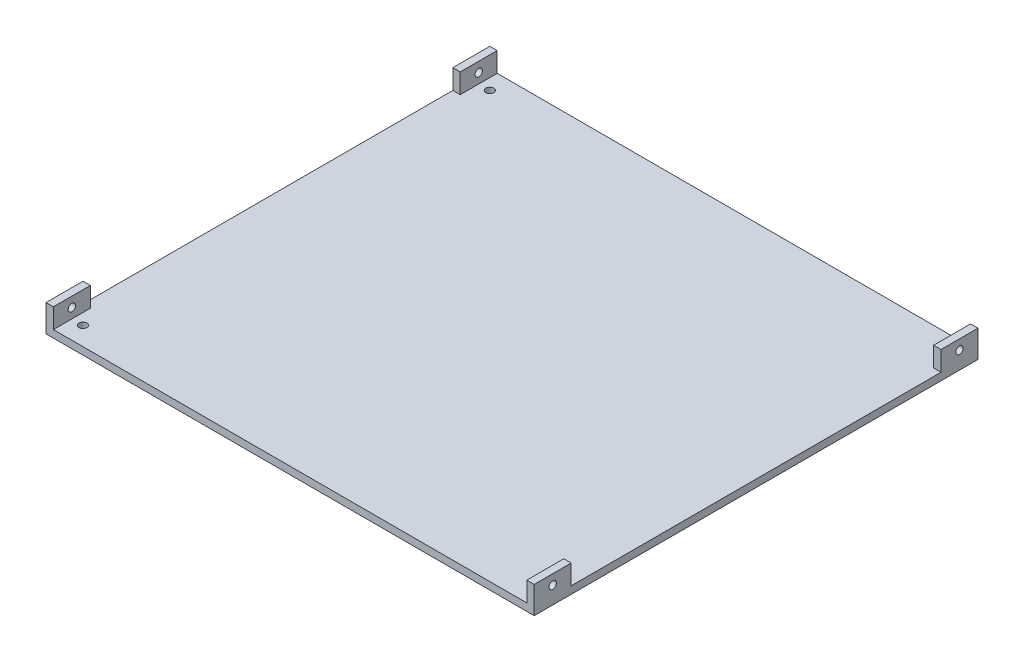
from build123d import *

# Parameters (mm, degrees)
SKETCH_1_W               = 198
SKETCH_1_H               = 180
SKETCH_1_R               = 1.6
EXTRUDE_1_DEPTH          = 3
SKETCH_2_W               = 3
SKETCH_2_H               = 15
EXTRUDE_2_DEPTH          = 8
CUT_EXTRUDE_1_DEPTH      = 135.033577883
CUT_EXTRUDE_1_DEPTH_BACK = 135.033577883
SKETCH_3_R               = 1.5


with BuildPart() as part:
    # Sketch 1 → Extrude 1 (new body)
    with BuildSketch(Plane(origin=(0, 0, 0), x_dir=(1, 0, 0), z_dir=(0, 1, 0))):
        Rectangle(SKETCH_1_W, SKETCH_1_H)
        with Locations(Location((-91.5, 82.5, 0), (0, 0, 270))):
            Circle(SKETCH_1_R, mode=Mode.SUBTRACT)
        with Locations(Location((91.5, 82.5, 0), (0, 0, 90))):
            Circle(SKETCH_1_R, mode=Mode.SUBTRACT)
        with Locations(Location((91.5, -82.5, 0), (0, 0, 270))):
            Circle(SKETCH_1_R, mode=Mode.SUBTRACT)
        with Locations(Location((-91.5, -82.5, 0), (0, 0, 90))):
            Circle(SKETCH_1_R, mode=Mode.SUBTRACT)
    extrude(amount=-EXTRUDE_1_DEPTH)

    # Sketch 2 → Extrude 2 (add)
    with BuildSketch(Plane(origin=(0, 0, 0), x_dir=(1, 0, 0), z_dir=(0, 1, 0))):
        with Locations((-97.5, 82.5)):
            Rectangle(SKETCH_2_W, SKETCH_2_H)
        with Locations((97.5, 82.5)):
            Rectangle(SKETCH_2_W, SKETCH_2_H)
        with Locations((97.5, -82.5)):
            Rectangle(SKETCH_2_W, SKETCH_2_H)
        with Locations((-97.5, -82.5)):
            Rectangle(SKETCH_2_W, SKETCH_2_H)
    extrude(amount=EXTRUDE_2_DEPTH)

    # Sketch 3 → Cut-Extrude 1 (cut, two sides: drawn at the far end of the back side and taken through both)
    with BuildSketch(Plane(origin=(0, 0, 0), x_dir=(0, 0, -1), z_dir=(1, 0, 0)).offset(-CUT_EXTRUDE_1_DEPTH_BACK)):
        with Locations((-82.5, 4)):
            Circle(SKETCH_3_R)
        with Locations((82.5, 4)):
            Circle(SKETCH_3_R)
    extrude(amount=CUT_EXTRUDE_1_DEPTH + CUT_EXTRUDE_1_DEPTH_BACK, mode=Mode.SUBTRACT)


solid = part.part
